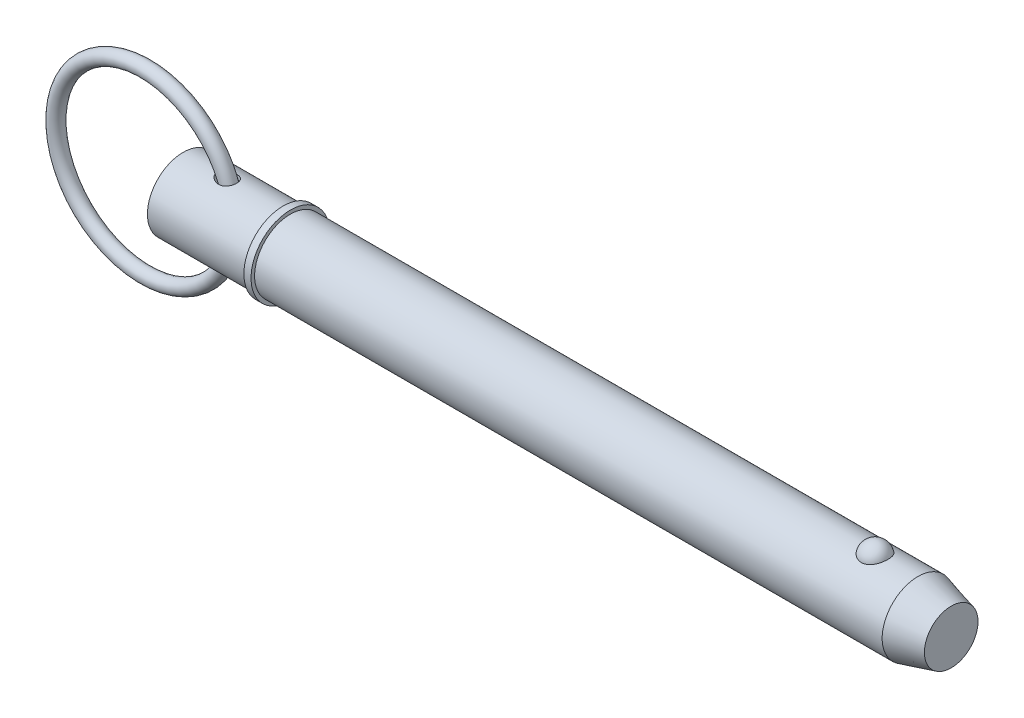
ISO-10303-21;
HEADER;
FILE_DESCRIPTION(('STEP AP214'),'2;1');
FILE_NAME('part.step','',(''),(''),'','','');
FILE_SCHEMA(('AUTOMOTIVE_DESIGN { 1 0 10303 214 1 1 1 1 }'));
ENDSEC;
DATA;
#1=APPLICATION_CONTEXT('core data for automotive mechanical design processes');
#2=APPLICATION_PROTOCOL_DEFINITION('international standard','automotive_design',2000,#1);
#3=PRODUCT_CONTEXT('',#1,'mechanical');
#4=PRODUCT('Part','Part','',(#3));
#5=PRODUCT_RELATED_PRODUCT_CATEGORY('part','',(#4));
#6=PRODUCT_DEFINITION_FORMATION('','',#4);
#7=PRODUCT_DEFINITION_CONTEXT('part definition',#1,'design');
#8=PRODUCT_DEFINITION('design','',#6,#7);
#9=PRODUCT_DEFINITION_SHAPE('','',#8);
#10=(LENGTH_UNIT() NAMED_UNIT(*) SI_UNIT(.MILLI.,.METRE.));
#11=(NAMED_UNIT(*) PLANE_ANGLE_UNIT() SI_UNIT($,.RADIAN.));
#12=(NAMED_UNIT(*) SI_UNIT($,.STERADIAN.) SOLID_ANGLE_UNIT());
#13=UNCERTAINTY_MEASURE_WITH_UNIT(LENGTH_MEASURE(1.E-05),#10,'distance_accuracy_value','');
#14=(GEOMETRIC_REPRESENTATION_CONTEXT(3) GLOBAL_UNCERTAINTY_ASSIGNED_CONTEXT((#13)) GLOBAL_UNIT_ASSIGNED_CONTEXT((#10,
#11,#12)) REPRESENTATION_CONTEXT('',''));
#15=CARTESIAN_POINT('',(0.,0.,0.));
#16=DIRECTION('',(0.,0.,1.));
#17=DIRECTION('',(1.,0.,0.));
#18=AXIS2_PLACEMENT_3D('',#15,#16,#17);
#19=CARTESIAN_POINT('',(-13.4840686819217,0.,0.));
#20=DIRECTION('',(0.,0.,1.));
#21=DIRECTION('',(1.,0.,0.));
#22=AXIS2_PLACEMENT_3D('',#19,#20,#21);
#23=TOROIDAL_SURFACE('',#22,31.75,2.54);
#24=CARTESIAN_POINT('',(20.8059313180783,0.,0.));
#25=VERTEX_POINT('',#24);
#26=VERTEX_LOOP('',#25);
#27=FACE_BOUND('',#26,.T.);
#28=ADVANCED_FACE('P0_F12',(#27),#23,.T.);
#29=CLOSED_SHELL('',(#28));
#30=MANIFOLD_SOLID_BREP('P0_B1',#29);
#31=CARTESIAN_POINT('',(0.,0.,0.));
#32=DIRECTION('',(1.,0.,0.));
#33=DIRECTION('',(0.,0.,-1.));
#34=AXIS2_PLACEMENT_3D('',#31,#32,#33);
#35=CYLINDRICAL_SURFACE('',#34,12.7);
#36=CARTESIAN_POINT('',(13.092900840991,12.5230976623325,-2.11234992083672));
#37=CARTESIAN_POINT('',(13.2535855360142,12.4976398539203,-2.26328363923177));
#38=CARTESIAN_POINT('',(13.4280602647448,12.4718592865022,-2.39955782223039));
#39=CARTESIAN_POINT('',(13.7976341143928,12.4229301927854,-2.64122157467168));
#40=CARTESIAN_POINT('',(13.9927568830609,12.3997847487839,-2.7465751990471));
#41=CARTESIAN_POINT('',(14.397672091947,12.3590534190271,-2.92439761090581));
#42=CARTESIAN_POINT('',(14.6074445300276,12.3414601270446,-2.99691026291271));
#43=CARTESIAN_POINT('',(15.0366557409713,12.3142893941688,-3.10669649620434));
#44=CARTESIAN_POINT('',(15.2560902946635,12.3047084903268,-3.14398530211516));
#45=CARTESIAN_POINT('',(15.5877843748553,12.2976819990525,-3.17128282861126));
#46=CARTESIAN_POINT('',(15.6989364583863,12.2965677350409,-3.17559470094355));
#47=CARTESIAN_POINT('',(15.9211629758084,12.2969101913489,-3.17427486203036));
#48=CARTESIAN_POINT('',(16.0322374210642,12.2983656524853,-3.16864802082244));
#49=CARTESIAN_POINT('',(16.2532861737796,12.3038832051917,-3.14715368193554));
#50=CARTESIAN_POINT('',(16.363260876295,12.3079443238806,-3.13129000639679));
#51=CARTESIAN_POINT('',(16.5810669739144,12.3185954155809,-3.08912320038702));
#52=CARTESIAN_POINT('',(16.6888986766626,12.3251850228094,-3.06282157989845));
#53=CARTESIAN_POINT('',(16.8894247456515,12.3398294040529,-3.00323791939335));
#54=CARTESIAN_POINT('',(16.9824664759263,12.3476389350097,-2.97106098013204));
#55=CARTESIAN_POINT('',(17.1651267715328,12.3648759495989,-2.89848824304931));
#56=CARTESIAN_POINT('',(17.2547457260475,12.3743032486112,-2.85809338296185));
#57=CARTESIAN_POINT('',(17.4297224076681,12.3944822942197,-2.76927391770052));
#58=CARTESIAN_POINT('',(17.5150817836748,12.40523352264,-2.72085245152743));
#59=CARTESIAN_POINT('',(17.6807665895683,12.4277046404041,-2.61629867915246));
#60=CARTESIAN_POINT('',(17.7610923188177,12.4394244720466,-2.56016683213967));
#61=CARTESIAN_POINT('',(17.9797287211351,12.4733252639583,-2.39133767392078));
#62=CARTESIAN_POINT('',(18.1114611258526,12.4961902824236,-2.27005507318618));
#63=CARTESIAN_POINT('',(18.3518677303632,12.5412050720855,-2.00648954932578));
#64=CARTESIAN_POINT('',(18.4605454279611,12.5633549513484,-1.86420981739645));
#65=CARTESIAN_POINT('',(18.6498843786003,12.6039384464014,-1.5661481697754));
#66=CARTESIAN_POINT('',(18.7311185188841,12.622444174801,-1.41073996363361));
#67=CARTESIAN_POINT('',(18.8669149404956,12.6543302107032,-1.08819514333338));
#68=CARTESIAN_POINT('',(18.921477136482,12.6677105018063,-0.921058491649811));
#69=CARTESIAN_POINT('',(19.0028875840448,12.6879542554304,-0.57902988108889));
#70=CARTESIAN_POINT('',(19.0296164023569,12.6947896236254,-0.40410783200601));
#71=CARTESIAN_POINT('',(19.0543673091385,12.7011128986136,-0.0521104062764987));
#72=CARTESIAN_POINT('',(19.0523885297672,12.7006005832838,0.124965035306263));
#73=CARTESIAN_POINT('',(19.019700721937,12.692266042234,0.476969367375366));
#74=CARTESIAN_POINT('',(18.9888798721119,12.6844153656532,0.651887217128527));
#75=CARTESIAN_POINT('',(18.8990221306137,12.6622099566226,0.99389064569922));
#76=CARTESIAN_POINT('',(18.839985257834,12.6478552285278,1.16097622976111));
#77=CARTESIAN_POINT('',(18.6951419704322,12.6142309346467,1.48231767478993));
#78=CARTESIAN_POINT('',(18.6093706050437,12.5949678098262,1.63659000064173));
#79=CARTESIAN_POINT('',(18.4131352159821,12.5536490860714,1.92810749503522));
#80=CARTESIAN_POINT('',(18.3026732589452,12.5315937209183,2.06535408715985));
#81=CARTESIAN_POINT('',(18.060669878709,12.4872833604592,2.31822774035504));
#82=CARTESIAN_POINT('',(17.9292520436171,12.4650302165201,2.43397343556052));
#83=CARTESIAN_POINT('',(17.6485957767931,12.4226514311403,2.64178289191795));
#84=CARTESIAN_POINT('',(17.4993587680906,12.4025256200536,2.73384854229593));
#85=CARTESIAN_POINT('',(17.1869531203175,12.3664726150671,2.8925825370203));
#86=CARTESIAN_POINT('',(17.0237450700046,12.3505578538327,2.95917592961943));
#87=CARTESIAN_POINT('',(16.6884731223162,12.3245177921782,3.06582547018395));
#88=CARTESIAN_POINT('',(16.516407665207,12.3143935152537,3.10587692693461));
#89=CARTESIAN_POINT('',(16.1604213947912,12.3003788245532,3.16093927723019));
#90=CARTESIAN_POINT('',(15.9763106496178,12.2967791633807,3.17478342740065));
#91=CARTESIAN_POINT('',(15.6080973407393,12.2966663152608,3.1752118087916));
#92=CARTESIAN_POINT('',(15.4239948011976,12.3001555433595,3.16178674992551));
#93=CARTESIAN_POINT('',(15.0417156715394,12.3141744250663,3.10676725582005));
#94=CARTESIAN_POINT('',(14.8439465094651,12.3253658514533,3.06251977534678));
#95=CARTESIAN_POINT('',(14.4574652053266,12.3538942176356,2.94531863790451));
#96=CARTESIAN_POINT('',(14.2687614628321,12.3712367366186,2.87233891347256));
#97=CARTESIAN_POINT('',(13.8856104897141,12.4121323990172,2.69045747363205));
#98=CARTESIAN_POINT('',(13.6926012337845,12.4361434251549,2.57861276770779));
#99=CARTESIAN_POINT('',(13.328588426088,12.4862632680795,2.32379935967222));
#100=CARTESIAN_POINT('',(13.1575718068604,12.5123708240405,2.18084927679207));
#101=CARTESIAN_POINT('',(12.8776146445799,12.5579467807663,1.89840233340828));
#102=CARTESIAN_POINT('',(12.7631663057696,12.5776642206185,1.76440341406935));
#103=CARTESIAN_POINT('',(12.5574911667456,12.6143643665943,1.47931295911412));
#104=CARTESIAN_POINT('',(12.4662309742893,12.6313509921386,1.32824646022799));
#105=CARTESIAN_POINT('',(12.3240650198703,12.6583901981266,1.03598403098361));
#106=CARTESIAN_POINT('',(12.2691183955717,12.6691064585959,0.89682285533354));
#107=CARTESIAN_POINT('',(12.1828741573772,12.6860954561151,0.611068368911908));
#108=CARTESIAN_POINT('',(12.1515620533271,12.6923709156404,0.464479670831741));
#109=CARTESIAN_POINT('',(12.1147168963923,12.6997676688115,0.167420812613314));
#110=CARTESIAN_POINT('',(12.109270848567,12.7008715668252,0.0169392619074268));
#111=CARTESIAN_POINT('',(12.1248234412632,12.6977391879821,-0.282592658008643));
#112=CARTESIAN_POINT('',(12.1458245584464,12.6935024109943,-0.431642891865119));
#113=CARTESIAN_POINT('',(12.210908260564,12.6805581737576,-0.716008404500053));
#114=CARTESIAN_POINT('',(12.2537133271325,12.6720986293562,-0.851633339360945));
#115=CARTESIAN_POINT('',(12.3591295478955,12.6516826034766,-1.11460776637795));
#116=CARTESIAN_POINT('',(12.4217455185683,12.6397252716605,-1.24195523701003));
#117=CARTESIAN_POINT('',(12.5735635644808,12.61152213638,-1.50300095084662));
#118=CARTESIAN_POINT('',(12.6652159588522,12.5949150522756,-1.63522875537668));
#119=CARTESIAN_POINT('',(12.8664347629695,12.5599626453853,-1.88501670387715));
#120=CARTESIAN_POINT('',(12.9760196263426,12.541615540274,-2.00256151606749));
#121=CARTESIAN_POINT('',(13.092900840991,12.5230976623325,-2.11234992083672));
#122=B_SPLINE_CURVE_WITH_KNOTS('',3,(#36,#37,#38,#39,#40,#41,#42,#43,#44,#45,#46,#47,#48,#49,
#50,#51,#52,#53,#54,#55,#56,#57,#58,#59,#60,#61,#62,#63,#64,#65,#66,#67,#68,#69,#70,#71,#72,#73,
#74,#75,#76,#77,#78,#79,#80,#81,#82,#83,#84,#85,#86,#87,#88,#89,#90,#91,#92,#93,#94,#95,#96,#97,
#98,#99,#100,#101,#102,#103,#104,#105,#106,#107,#108,#109,#110,#111,#112,#113,#114,#115,#116,
#117,#118,#119,#120,#121),.UNSPECIFIED.,.T.,.F.,(4,2,2,2,2,2,2,2,2,2,2,2,2,2,2,2,2,2,2,2,2,2,2,
2,2,2,2,2,2,2,2,2,2,2,2,2,2,2,2,2,2,2,4),(0.,0.665132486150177,1.33103515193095,
1.99604575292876,2.66076878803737,2.99410229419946,3.32727250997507,3.66031840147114,
3.99331613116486,4.28918991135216,4.58502994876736,4.88075456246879,5.17646157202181,
5.71510826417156,6.25367317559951,6.78017774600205,7.30668400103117,7.83544030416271,
8.36421259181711,8.89504347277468,9.42587399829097,9.95601150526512,10.4861046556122,
11.0131799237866,11.54021312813,12.0687854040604,12.597451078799,13.1491450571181,
13.7010270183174,14.3074556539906,14.914435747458,15.5844380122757,16.2540403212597,
16.7839879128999,17.3131679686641,17.7612578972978,18.2090728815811,18.658393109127,
19.1077554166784,19.5333866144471,19.959121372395,20.4424347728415,20.9262486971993),.UNSPECIFIED.);
#123=CARTESIAN_POINT('',(13.092900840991,12.5230976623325,-2.11234992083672));
#124=VERTEX_POINT('',#123);
#125=EDGE_CURVE('P1_E42',#124,#124,#122,.T.);
#126=ORIENTED_EDGE('',*,*,#125,.T.);
#127=EDGE_LOOP('',(#126));
#128=FACE_BOUND('',#127,.T.);
#129=CARTESIAN_POINT('',(0.,0.,0.));
#130=DIRECTION('',(1.,0.,0.));
#131=DIRECTION('',(0.,0.,-1.));
#132=AXIS2_PLACEMENT_3D('',#129,#130,#131);
#133=CIRCLE('',#132,12.7);
#134=CARTESIAN_POINT('',(0.,0.,-12.7));
#135=VERTEX_POINT('',#134);
#136=EDGE_CURVE('P1_E9',#135,#135,#133,.T.);
#137=ORIENTED_EDGE('',*,*,#136,.T.);
#138=EDGE_LOOP('',(#137));
#139=FACE_BOUND('',#138,.T.);
#140=CARTESIAN_POINT('',(35.56,0.,0.));
#141=DIRECTION('',(1.,0.,0.));
#142=DIRECTION('',(0.,0.,-1.));
#143=AXIS2_PLACEMENT_3D('',#140,#141,#142);
#144=CIRCLE('',#143,12.7);
#145=CARTESIAN_POINT('',(35.56,0.,-12.7));
#146=VERTEX_POINT('',#145);
#147=EDGE_CURVE('P1_E25',#146,#146,#144,.T.);
#148=ORIENTED_EDGE('',*,*,#147,.F.);
#149=EDGE_LOOP('',(#148));
#150=FACE_BOUND('',#149,.T.);
#151=CARTESIAN_POINT('',(13.092900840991,-12.5230976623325,-2.11234992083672));
#152=CARTESIAN_POINT('',(12.9659872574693,-12.5432050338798,-1.99314161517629));
#153=CARTESIAN_POINT('',(12.847667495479,-12.5631124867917,-1.86478966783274));
#154=CARTESIAN_POINT('',(12.6324721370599,-12.6007427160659,-1.59069749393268));
#155=CARTESIAN_POINT('',(12.5355833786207,-12.6184668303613,-1.444968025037));
#156=CARTESIAN_POINT('',(12.4099071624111,-12.642034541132,-1.21450950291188));
#157=CARTESIAN_POINT('',(12.3711427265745,-12.6494175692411,-1.13527163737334));
#158=CARTESIAN_POINT('',(12.3010994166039,-12.6628962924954,-0.973464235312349));
#159=CARTESIAN_POINT('',(12.2698164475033,-12.6689926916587,-0.890896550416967));
#160=CARTESIAN_POINT('',(12.2153933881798,-12.6796767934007,-0.72309085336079));
#161=CARTESIAN_POINT('',(12.192246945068,-12.6842656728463,-0.637854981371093));
#162=CARTESIAN_POINT('',(12.154603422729,-12.6917620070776,-0.465421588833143));
#163=CARTESIAN_POINT('',(12.1401047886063,-12.69466976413,-0.378224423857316));
#164=CARTESIAN_POINT('',(12.1214471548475,-12.6984180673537,-0.214417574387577));
#165=CARTESIAN_POINT('',(12.1161713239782,-12.699481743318,-0.13793855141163));
#166=CARTESIAN_POINT('',(12.1124989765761,-12.7002217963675,0.0152189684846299));
#167=CARTESIAN_POINT('',(12.1141046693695,-12.6998977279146,0.0918975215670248));
#168=CARTESIAN_POINT('',(12.1241695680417,-12.6978712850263,0.244746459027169));
#169=CARTESIAN_POINT('',(12.132625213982,-12.6961696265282,0.320917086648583));
#170=CARTESIAN_POINT('',(12.1562110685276,-12.6914452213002,0.472185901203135));
#171=CARTESIAN_POINT('',(12.1713438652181,-12.6884219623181,0.547283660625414));
#172=CARTESIAN_POINT('',(12.223731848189,-12.6780227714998,0.759415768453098));
#173=CARTESIAN_POINT('',(12.268839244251,-12.6691353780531,0.894507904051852));
#174=CARTESIAN_POINT('',(12.3786059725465,-12.6479567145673,1.1560647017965));
#175=CARTESIAN_POINT('',(12.4432700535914,-12.6356646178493,1.28252725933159));
#176=CARTESIAN_POINT('',(12.5971341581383,-12.607236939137,1.5381272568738));
#177=CARTESIAN_POINT('',(12.6882234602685,-12.5908303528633,1.66609325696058));
#178=CARTESIAN_POINT('',(12.887209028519,-12.5564642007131,1.90792082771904));
#179=CARTESIAN_POINT('',(12.995115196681,-12.5385037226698,2.02177401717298));
#180=CARTESIAN_POINT('',(13.2471335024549,-12.4987806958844,2.25547266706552));
#181=CARTESIAN_POINT('',(13.3941979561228,-12.4769622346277,2.3721269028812));
#182=CARTESIAN_POINT('',(13.7036983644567,-12.4349587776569,2.58329351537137));
#183=CARTESIAN_POINT('',(13.8661464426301,-12.4147750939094,2.67778822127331));
#184=CARTESIAN_POINT('',(14.2306024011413,-12.3748157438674,2.85722657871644));
#185=CARTESIAN_POINT('',(14.4347220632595,-12.3556533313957,2.93804226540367));
#186=CARTESIAN_POINT('',(14.8540416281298,-12.3245430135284,3.06594877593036));
#187=CARTESIAN_POINT('',(15.0692453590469,-12.3125976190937,3.11302786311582));
#188=CARTESIAN_POINT('',(15.3981213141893,-12.3014943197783,3.15648626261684));
#189=CARTESIAN_POINT('',(15.5100235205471,-12.298940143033,3.16639841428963));
#190=CARTESIAN_POINT('',(15.7342812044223,-12.2963942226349,3.17627668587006));
#191=CARTESIAN_POINT('',(15.8466364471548,-12.2964012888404,3.17624742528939));
#192=CARTESIAN_POINT('',(16.0707903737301,-12.2990694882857,3.16589868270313));
#193=CARTESIAN_POINT('',(16.1825892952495,-12.3017293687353,3.1555840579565));
#194=CARTESIAN_POINT('',(16.4046123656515,-12.3096862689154,3.12440163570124));
#195=CARTESIAN_POINT('',(16.514836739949,-12.314982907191,3.10353536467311));
#196=CARTESIAN_POINT('',(16.7211934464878,-12.3273933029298,3.05384263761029));
#197=CARTESIAN_POINT('',(16.8175961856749,-12.3342598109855,3.0260738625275));
#198=CARTESIAN_POINT('',(17.0073515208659,-12.3498131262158,2.96195947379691));
#199=CARTESIAN_POINT('',(17.100704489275,-12.3584997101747,2.92561491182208));
#200=CARTESIAN_POINT('',(17.2834584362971,-12.3774243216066,2.84448580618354));
#201=CARTESIAN_POINT('',(17.3728610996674,-12.3876616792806,2.79970490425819));
#202=CARTESIAN_POINT('',(17.5469061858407,-12.409352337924,2.701939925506));
#203=CARTESIAN_POINT('',(17.6315489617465,-12.4208055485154,2.64895645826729));
#204=CARTESIAN_POINT('',(17.7872886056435,-12.4433734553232,2.54070972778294));
#205=CARTESIAN_POINT('',(17.8589017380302,-12.4544123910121,2.4861716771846));
#206=CARTESIAN_POINT('',(17.9970802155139,-12.4768404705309,2.37105291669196));
#207=CARTESIAN_POINT('',(18.063643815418,-12.4882297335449,2.31047013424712));
#208=CARTESIAN_POINT('',(18.1911677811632,-12.5110137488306,2.18372894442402));
#209=CARTESIAN_POINT('',(18.2521311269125,-12.5224084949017,2.11757353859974));
#210=CARTESIAN_POINT('',(18.3680676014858,-12.5448751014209,1.98014449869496));
#211=CARTESIAN_POINT('',(18.4230385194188,-12.5559468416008,1.90886899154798));
#212=CARTESIAN_POINT('',(18.5752306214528,-12.5875288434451,1.6925769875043));
#213=CARTESIAN_POINT('',(18.6637018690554,-12.6071482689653,1.54111740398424));
#214=CARTESIAN_POINT('',(18.8143485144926,-12.6417556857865,1.225260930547));
#215=CARTESIAN_POINT('',(18.876524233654,-12.6567437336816,1.06086419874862));
#216=CARTESIAN_POINT('',(18.9733884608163,-12.6805238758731,0.723195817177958));
#217=CARTESIAN_POINT('',(19.0079967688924,-12.6892978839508,0.549899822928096));
#218=CARTESIAN_POINT('',(19.0486500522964,-12.6996362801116,0.199781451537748));
#219=CARTESIAN_POINT('',(19.054694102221,-12.7012004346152,0.0229589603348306));
#220=CARTESIAN_POINT('',(19.0380549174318,-12.6969431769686,-0.330044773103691));
#221=CARTESIAN_POINT('',(19.0152419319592,-12.6910884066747,-0.506219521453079));
#222=CARTESIAN_POINT('',(18.9411599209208,-12.672565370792,-0.852112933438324));
#223=CARTESIAN_POINT('',(18.8898907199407,-12.659897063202,-1.0218315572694));
#224=CARTESIAN_POINT('',(18.7600888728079,-12.6291327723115,-1.34987035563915));
#225=CARTESIAN_POINT('',(18.6815715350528,-12.6110398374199,-1.50819687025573));
#226=CARTESIAN_POINT('',(18.4991526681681,-12.5714188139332,-1.808997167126));
#227=CARTESIAN_POINT('',(18.3952529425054,-12.5498909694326,-1.95147207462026));
#228=CARTESIAN_POINT('',(18.1653806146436,-12.5059234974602,-2.21580059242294));
#229=CARTESIAN_POINT('',(18.0395297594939,-12.4834893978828,-2.33776101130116));
#230=CARTESIAN_POINT('',(17.7688701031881,-12.4400863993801,-2.55870399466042));
#231=CARTESIAN_POINT('',(17.624063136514,-12.4191173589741,-2.65768878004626));
#232=CARTESIAN_POINT('',(17.3196803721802,-12.380896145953,-2.8304192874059));
#233=CARTESIAN_POINT('',(17.1601036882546,-12.3636441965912,-2.90416349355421));
#234=CARTESIAN_POINT('',(16.8308162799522,-12.3345597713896,-3.02531546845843));
#235=CARTESIAN_POINT('',(16.6611041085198,-12.322728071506,-3.07271946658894));
#236=CARTESIAN_POINT('',(16.3099674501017,-12.3051318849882,-3.14246490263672));
#237=CARTESIAN_POINT('',(16.1283412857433,-12.2996014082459,-3.16384159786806));
#238=CARTESIAN_POINT('',(15.7639014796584,-12.2955807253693,-3.17942379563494));
#239=CARTESIAN_POINT('',(15.5810875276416,-12.2970924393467,-3.17362188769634));
#240=CARTESIAN_POINT('',(15.20154276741,-12.307074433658,-3.13470416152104));
#241=CARTESIAN_POINT('',(15.0050835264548,-12.316173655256,-3.09911848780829));
#242=CARTESIAN_POINT('',(14.6197996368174,-12.3407987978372,-2.99954607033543));
#243=CARTESIAN_POINT('',(14.4309834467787,-12.3563316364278,-2.93552875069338));
#244=CARTESIAN_POINT('',(14.0353751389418,-12.3949378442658,-2.76840280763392));
#245=CARTESIAN_POINT('',(13.8306109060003,-12.4188242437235,-2.66064798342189));
#246=CARTESIAN_POINT('',(13.4432099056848,-12.4696241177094,-2.4113475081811));
#247=CARTESIAN_POINT('',(13.2605568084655,-12.4965353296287,-2.26982702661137));
#248=CARTESIAN_POINT('',(13.092900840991,-12.5230976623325,-2.11234992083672));
#249=B_SPLINE_CURVE_WITH_KNOTS('',3,(#151,#152,#153,#154,#155,#156,#157,#158,#159,#160,#161,
#162,#163,#164,#165,#166,#167,#168,#169,#170,#171,#172,#173,#174,#175,#176,#177,#178,#179,#180,
#181,#182,#183,#184,#185,#186,#187,#188,#189,#190,#191,#192,#193,#194,#195,#196,#197,#198,#199,
#200,#201,#202,#203,#204,#205,#206,#207,#208,#209,#210,#211,#212,#213,#214,#215,#216,#217,#218,
#219,#220,#221,#222,#223,#224,#225,#226,#227,#228,#229,#230,#231,#232,#233,#234,#235,#236,#237,
#238,#239,#240,#241,#242,#243,#244,#245,#246,#247,#248),.UNSPECIFIED.,.T.,.F.,(4,2,2,2,2,2,2,2,
2,2,2,2,2,2,2,2,2,2,2,2,2,2,2,2,2,2,2,2,2,2,2,2,2,2,2,2,2,2,2,2,2,2,2,2,2,2,2,2,4),(0.,
0.525289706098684,1.05025590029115,1.31549608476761,1.58059075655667,1.84547798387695,
2.11031756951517,2.34000998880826,2.56977615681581,2.79942299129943,3.0291589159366,
3.45531787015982,3.8815803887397,4.35362362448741,4.82594586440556,5.39074449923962,
5.95599200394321,6.61421946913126,7.27267581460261,7.60939383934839,7.94595540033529,
8.2823580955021,8.61871213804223,8.91997243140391,9.22119579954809,9.52228943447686,
9.82336070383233,10.0950952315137,10.3669232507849,10.6386057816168,10.9103882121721,
11.4371688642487,11.9639430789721,12.4922442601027,13.0205625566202,13.5512648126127,
14.0819703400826,14.6123781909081,15.1427483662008,15.6702654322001,16.1977314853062,
16.7252292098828,17.2528024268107,17.7993878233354,18.3461222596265,18.9432829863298,
19.5410874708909,20.2355241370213,20.9294447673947),.UNSPECIFIED.);
#250=CARTESIAN_POINT('',(13.092900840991,-12.5230976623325,-2.11234992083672));
#251=VERTEX_POINT('',#250);
#252=EDGE_CURVE('P1_E17',#251,#251,#249,.T.);
#253=ORIENTED_EDGE('',*,*,#252,.T.);
#254=EDGE_LOOP('',(#253));
#255=FACE_BOUND('',#254,.T.);
#256=ADVANCED_FACE('P1_F13',(#128,#139,#150,#255),#35,.T.);
#257=CARTESIAN_POINT('',(0.,0.,0.));
#258=DIRECTION('',(1.,0.,0.));
#259=DIRECTION('',(0.,0.,-1.));
#260=AXIS2_PLACEMENT_3D('',#257,#258,#259);
#261=CYLINDRICAL_SURFACE('',#260,12.7);
#262=CARTESIAN_POINT('',(261.200738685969,0.,0.));
#263=DIRECTION('',(1.,0.,0.));
#264=DIRECTION('',(0.,0.,-1.));
#265=AXIS2_PLACEMENT_3D('',#262,#263,#264);
#266=CIRCLE('',#265,12.7);
#267=CARTESIAN_POINT('',(261.200738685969,0.,-12.7));
#268=VERTEX_POINT('',#267);
#269=EDGE_CURVE('P1_E99',#268,#268,#266,.T.);
#270=ORIENTED_EDGE('',*,*,#269,.F.);
#271=EDGE_LOOP('',(#270));
#272=FACE_BOUND('',#271,.T.);
#273=CARTESIAN_POINT('',(38.1,0.,0.));
#274=DIRECTION('',(1.,0.,0.));
#275=DIRECTION('',(0.,0.,-1.));
#276=AXIS2_PLACEMENT_3D('',#273,#274,#275);
#277=CIRCLE('',#276,12.7);
#278=CARTESIAN_POINT('',(38.1,0.,-12.7));
#279=VERTEX_POINT('',#278);
#280=EDGE_CURVE('P1_E96',#279,#279,#277,.T.);
#281=ORIENTED_EDGE('',*,*,#280,.T.);
#282=EDGE_LOOP('',(#281));
#283=FACE_BOUND('',#282,.T.);
#284=CARTESIAN_POINT('',(245.960042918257,11.7500437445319,4.8193850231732));
#285=CARTESIAN_POINT('',(245.835088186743,11.7500430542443,4.81938571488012));
#286=CARTESIAN_POINT('',(245.710144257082,11.7520975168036,4.81438658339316));
#287=CARTESIAN_POINT('',(245.461142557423,11.760253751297,4.79442904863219));
#288=CARTESIAN_POINT('',(245.337085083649,11.7663568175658,4.77946746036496));
#289=CARTESIAN_POINT('',(245.090901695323,11.7824262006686,4.73971414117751));
#290=CARTESIAN_POINT('',(244.968774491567,11.7923898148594,4.71492928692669));
#291=CARTESIAN_POINT('',(244.727187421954,11.8158938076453,4.65571340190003));
#292=CARTESIAN_POINT('',(244.60772859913,11.8294355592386,4.62127866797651));
#293=CARTESIAN_POINT('',(244.372557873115,11.8596812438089,4.54309502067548));
#294=CARTESIAN_POINT('',(244.256839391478,11.8763792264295,4.49936361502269));
#295=CARTESIAN_POINT('',(244.029653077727,11.9124878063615,4.40287235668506));
#296=CARTESIAN_POINT('',(243.918186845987,11.9318994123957,4.35010914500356));
#297=CARTESIAN_POINT('',(243.591278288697,11.9934256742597,4.17881316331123));
#298=CARTESIAN_POINT('',(243.383127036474,12.038858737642,4.04720756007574));
#299=CARTESIAN_POINT('',(242.985850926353,12.1352173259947,3.748564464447));
#300=CARTESIAN_POINT('',(242.797443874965,12.1862630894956,3.58061821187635));
#301=CARTESIAN_POINT('',(242.450521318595,12.2875163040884,3.21600758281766));
#302=CARTESIAN_POINT('',(242.292011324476,12.3377235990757,3.01933792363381));
#303=CARTESIAN_POINT('',(242.00168878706,12.4344923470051,2.592916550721));
#304=CARTESIAN_POINT('',(241.871376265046,12.4807925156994,2.36208286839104));
#305=CARTESIAN_POINT('',(241.649407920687,12.5623454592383,1.88070399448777));
#306=CARTESIAN_POINT('',(241.557755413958,12.5975972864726,1.63015711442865));
#307=CARTESIAN_POINT('',(241.414046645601,12.6538414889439,1.11298869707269));
#308=CARTESIAN_POINT('',(241.362499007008,12.6746503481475,0.846205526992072));
#309=CARTESIAN_POINT('',(241.301977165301,12.699153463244,0.307085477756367));
#310=CARTESIAN_POINT('',(241.293001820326,12.7028481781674,0.0347487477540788));
#311=CARTESIAN_POINT('',(241.317731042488,12.6927785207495,-0.50607334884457));
#312=CARTESIAN_POINT('',(241.351189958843,12.6791146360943,-0.774571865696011));
#313=CARTESIAN_POINT('',(241.459687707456,12.635882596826,-1.30170246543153));
#314=CARTESIAN_POINT('',(241.53472729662,12.606314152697,-1.56033436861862));
#315=CARTESIAN_POINT('',(241.72500006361,12.5342328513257,-2.0608389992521));
#316=CARTESIAN_POINT('',(241.840287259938,12.4917026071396,-2.30268867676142));
#317=CARTESIAN_POINT('',(242.108704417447,12.3981123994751,-2.76259600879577));
#318=CARTESIAN_POINT('',(242.261837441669,12.3470517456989,-2.98065173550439));
#319=CARTESIAN_POINT('',(242.603507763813,12.2416045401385,-3.38786328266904));
#320=CARTESIAN_POINT('',(242.792201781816,12.1872040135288,-3.57688418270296));
#321=CARTESIAN_POINT('',(243.200239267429,12.0814086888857,-3.91941073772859));
#322=CARTESIAN_POINT('',(243.419580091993,12.0300136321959,-4.07291945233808));
#323=CARTESIAN_POINT('',(243.878375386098,11.9373542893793,-4.3369128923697));
#324=CARTESIAN_POINT('',(244.117304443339,11.8958982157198,-4.44824125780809));
#325=CARTESIAN_POINT('',(244.61243761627,11.8268116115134,-4.62881985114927));
#326=CARTESIAN_POINT('',(244.868635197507,11.7991758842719,-4.69808589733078));
#327=CARTESIAN_POINT('',(245.377164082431,11.7622209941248,-4.78983181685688));
#328=CARTESIAN_POINT('',(245.629041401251,11.7520502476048,-4.81449025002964));
#329=CARTESIAN_POINT('',(246.133573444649,11.7485796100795,-4.82295735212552));
#330=CARTESIAN_POINT('',(246.386228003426,11.7552763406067,-4.80677420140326));
#331=CARTESIAN_POINT('',(246.876834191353,11.7842584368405,-4.73525430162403));
#332=CARTESIAN_POINT('',(247.114998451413,11.8060486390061,-4.68116061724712));
#333=CARTESIAN_POINT('',(247.578489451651,11.8622750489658,-4.53678133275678));
#334=CARTESIAN_POINT('',(247.803815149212,11.8967122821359,-4.44649279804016));
#335=CARTESIAN_POINT('',(248.240801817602,11.9754603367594,-4.22987613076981));
#336=CARTESIAN_POINT('',(248.452057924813,12.0199699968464,-4.10280539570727));
#337=CARTESIAN_POINT('',(248.850601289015,12.1138028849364,-3.81685409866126));
#338=CARTESIAN_POINT('',(249.037883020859,12.163127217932,-3.65796622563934));
#339=CARTESIAN_POINT('',(249.393350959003,12.2642343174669,-3.30364864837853));
#340=CARTESIAN_POINT('',(249.560111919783,12.3160165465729,-3.10678783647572));
#341=CARTESIAN_POINT('',(249.859579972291,12.4142566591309,-2.68748409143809));
#342=CARTESIAN_POINT('',(249.992280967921,12.4607135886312,-2.46503658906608));
#343=CARTESIAN_POINT('',(250.224691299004,12.5450236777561,-1.99289519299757));
#344=CARTESIAN_POINT('',(250.323215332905,12.5825557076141,-1.74255918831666));
#345=CARTESIAN_POINT('',(250.479227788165,12.6431720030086,-1.22773734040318));
#346=CARTESIAN_POINT('',(250.536715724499,12.6662560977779,-0.963251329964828));
#347=CARTESIAN_POINT('',(250.609544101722,12.6956486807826,-0.427355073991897));
#348=CARTESIAN_POINT('',(250.624837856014,12.7019385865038,-0.15593749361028));
#349=CARTESIAN_POINT('',(250.612779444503,12.6970201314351,0.385928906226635));
#350=CARTESIAN_POINT('',(250.58542805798,12.6858120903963,0.656377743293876));
#351=CARTESIAN_POINT('',(250.513060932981,12.6568455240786,1.05454017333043));
#352=CARTESIAN_POINT('',(250.483796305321,12.6451962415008,1.18577850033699));
#353=CARTESIAN_POINT('',(250.415022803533,12.6181819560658,1.4451380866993));
#354=CARTESIAN_POINT('',(250.375517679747,12.6028183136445,1.57326046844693));
#355=CARTESIAN_POINT('',(250.286439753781,12.5687547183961,1.82554978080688));
#356=CARTESIAN_POINT('',(250.236862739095,12.5500533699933,1.94971503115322));
#357=CARTESIAN_POINT('',(250.12792115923,12.5098093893,2.19314370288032));
#358=CARTESIAN_POINT('',(250.068560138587,12.4882677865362,2.31240887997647));
#359=CARTESIAN_POINT('',(249.93997128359,12.4427679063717,2.5459303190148));
#360=CARTESIAN_POINT('',(249.870688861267,12.4187964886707,2.66015396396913));
#361=CARTESIAN_POINT('',(249.722903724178,12.3691892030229,2.88202659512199));
#362=CARTESIAN_POINT('',(249.644404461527,12.3435539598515,2.98967802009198));
#363=CARTESIAN_POINT('',(249.47855022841,12.2912955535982,3.1977438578));
#364=CARTESIAN_POINT('',(249.391191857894,12.2646720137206,3.29815546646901));
#365=CARTESIAN_POINT('',(249.208161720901,12.2111945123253,3.49095035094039));
#366=CARTESIAN_POINT('',(249.112493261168,12.1843406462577,3.5833367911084));
#367=CARTESIAN_POINT('',(248.913627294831,12.1312249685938,3.75922876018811));
#368=CARTESIAN_POINT('',(248.810450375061,12.104961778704,3.84275713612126));
#369=CARTESIAN_POINT('',(248.597013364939,12.0537284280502,4.00056406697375));
#370=CARTESIAN_POINT('',(248.486756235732,12.028757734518,4.07484645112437));
#371=CARTESIAN_POINT('',(248.259755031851,11.9808306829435,4.21367959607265));
#372=CARTESIAN_POINT('',(248.143006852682,11.9578756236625,4.27822410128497));
#373=CARTESIAN_POINT('',(247.90394258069,11.9147184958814,4.39698483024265));
#374=CARTESIAN_POINT('',(247.781628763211,11.894515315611,4.45120522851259));
#375=CARTESIAN_POINT('',(247.522952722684,11.8561129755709,4.55255353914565));
#376=CARTESIAN_POINT('',(247.386223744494,11.8381764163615,4.59884858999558));
#377=CARTESIAN_POINT('',(247.108608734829,11.8069093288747,4.67853897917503));
#378=CARTESIAN_POINT('',(246.967724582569,11.7935767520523,4.71194005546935));
#379=CARTESIAN_POINT('',(246.68309446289,11.7720277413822,4.76552188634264));
#380=CARTESIAN_POINT('',(246.539348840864,11.7638106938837,4.78570422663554));
#381=CARTESIAN_POINT('',(246.250411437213,11.7528195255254,4.81263433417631));
#382=CARTESIAN_POINT('',(246.105219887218,11.7500445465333,4.81938421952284));
#383=CARTESIAN_POINT('',(245.960042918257,11.7500437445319,4.8193850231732));
#384=B_SPLINE_CURVE_WITH_KNOTS('',3,(#284,#285,#286,#287,#288,#289,#290,#291,#292,#293,#294,
#295,#296,#297,#298,#299,#300,#301,#302,#303,#304,#305,#306,#307,#308,#309,#310,#311,#312,#313,
#314,#315,#316,#317,#318,#319,#320,#321,#322,#323,#324,#325,#326,#327,#328,#329,#330,#331,#332,
#333,#334,#335,#336,#337,#338,#339,#340,#341,#342,#343,#344,#345,#346,#347,#348,#349,#350,#351,
#352,#353,#354,#355,#356,#357,#358,#359,#360,#361,#362,#363,#364,#365,#366,#367,#368,#369,#370,
#371,#372,#373,#374,#375,#376,#377,#378,#379,#380,#381,#382,#383),.UNSPECIFIED.,.T.,.F.,(4,2,2,
2,2,2,2,2,2,2,2,2,2,2,2,2,2,2,2,2,2,2,2,2,2,2,2,2,2,2,2,2,2,2,2,2,2,2,2,2,2,2,2,2,2,2,2,2,2,4),
(0.,0.374729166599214,0.749578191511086,1.12416526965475,1.49889629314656,1.87292776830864,
2.24709865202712,2.99481328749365,3.7639944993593,4.53331735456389,5.33683915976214,
6.14042986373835,6.95405296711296,7.76765424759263,8.57656703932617,9.38549455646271,
10.1955119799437,11.0055949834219,11.8193353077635,12.6330054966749,13.4294141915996,
14.2255231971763,14.9815786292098,15.7374826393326,16.4696948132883,17.2019663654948,
17.9501979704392,18.6986017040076,19.4844704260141,20.2704797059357,21.0815215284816,
21.8925729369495,22.70452139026,23.5164550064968,23.9209608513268,24.3253187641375,
24.7298461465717,25.1342272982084,25.5409255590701,25.947471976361,26.3541750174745,
26.7607169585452,27.166183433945,27.5714814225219,27.9770386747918,28.3824315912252,
28.8181206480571,29.2536155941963,29.6890582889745,30.1244323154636),.UNSPECIFIED.);
#385=CARTESIAN_POINT('',(245.960042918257,11.7500437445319,4.8193850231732));
#386=VERTEX_POINT('',#385);
#387=EDGE_CURVE('P1_E34',#386,#386,#384,.T.);
#388=ORIENTED_EDGE('',*,*,#387,.T.);
#389=EDGE_LOOP('',(#388));
#390=FACE_BOUND('',#389,.T.);
#391=ADVANCED_FACE('P1_F46',(#272,#283,#390),#261,.T.);
#392=CARTESIAN_POINT('',(0.,0.,0.));
#393=DIRECTION('',(-1.,0.,0.));
#394=DIRECTION('',(0.,0.,1.));
#395=AXIS2_PLACEMENT_3D('',#392,#393,#394);
#396=PLANE('',#395);
#397=ORIENTED_EDGE('',*,*,#136,.F.);
#398=EDGE_LOOP('',(#397));
#399=FACE_BOUND('',#398,.T.);
#400=ADVANCED_FACE('P1_F15',(#399),#396,.T.);
#401=CARTESIAN_POINT('',(35.56,12.7,0.));
#402=DIRECTION('',(-1.,0.,0.));
#403=DIRECTION('',(0.,0.,1.));
#404=AXIS2_PLACEMENT_3D('',#401,#402,#403);
#405=PLANE('',#404);
#406=ORIENTED_EDGE('',*,*,#147,.T.);
#407=EDGE_LOOP('',(#406));
#408=FACE_BOUND('',#407,.T.);
#409=CARTESIAN_POINT('',(35.56,0.,0.));
#410=DIRECTION('',(1.,0.,0.));
#411=DIRECTION('',(0.,0.,-1.));
#412=AXIS2_PLACEMENT_3D('',#409,#410,#411);
#413=CIRCLE('',#412,13.97);
#414=CARTESIAN_POINT('',(35.56,0.,-13.97));
#415=VERTEX_POINT('',#414);
#416=EDGE_CURVE('P1_E30',#415,#415,#413,.T.);
#417=ORIENTED_EDGE('',*,*,#416,.F.);
#418=EDGE_LOOP('',(#417));
#419=FACE_BOUND('',#418,.T.);
#420=ADVANCED_FACE('P1_F81',(#408,#419),#405,.T.);
#421=CARTESIAN_POINT('',(0.,0.,0.));
#422=DIRECTION('',(1.,0.,0.));
#423=DIRECTION('',(0.,0.,-1.));
#424=AXIS2_PLACEMENT_3D('',#421,#422,#423);
#425=CYLINDRICAL_SURFACE('',#424,13.97);
#426=ORIENTED_EDGE('',*,*,#416,.T.);
#427=EDGE_LOOP('',(#426));
#428=FACE_BOUND('',#427,.T.);
#429=CARTESIAN_POINT('',(38.1,0.,0.));
#430=DIRECTION('',(1.,0.,0.));
#431=DIRECTION('',(0.,0.,-1.));
#432=AXIS2_PLACEMENT_3D('',#429,#430,#431);
#433=CIRCLE('',#432,13.97);
#434=CARTESIAN_POINT('',(38.1,0.,-13.97));
#435=VERTEX_POINT('',#434);
#436=EDGE_CURVE('P1_E95',#435,#435,#433,.T.);
#437=ORIENTED_EDGE('',*,*,#436,.F.);
#438=EDGE_LOOP('',(#437));
#439=FACE_BOUND('',#438,.T.);
#440=ADVANCED_FACE('P1_F68',(#428,#439),#425,.T.);
#441=CARTESIAN_POINT('',(38.1,13.97,0.));
#442=DIRECTION('',(1.,0.,0.));
#443=DIRECTION('',(0.,0.,-1.));
#444=AXIS2_PLACEMENT_3D('',#441,#442,#443);
#445=PLANE('',#444);
#446=ORIENTED_EDGE('',*,*,#436,.T.);
#447=EDGE_LOOP('',(#446));
#448=FACE_BOUND('',#447,.T.);
#449=ORIENTED_EDGE('',*,*,#280,.F.);
#450=EDGE_LOOP('',(#449));
#451=FACE_BOUND('',#450,.T.);
#452=ADVANCED_FACE('P1_F62',(#448,#451),#445,.T.);
#453=CARTESIAN_POINT('',(273.05,0.,0.));
#454=DIRECTION('',(-1.,0.,0.));
#455=DIRECTION('',(0.,0.,1.));
#456=AXIS2_PLACEMENT_3D('',#453,#454,#455);
#457=CONICAL_SURFACE('',#456,9.52500000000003,0.26179938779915);
#458=ORIENTED_EDGE('',*,*,#269,.T.);
#459=EDGE_LOOP('',(#458));
#460=FACE_BOUND('',#459,.T.);
#461=CARTESIAN_POINT('',(273.05,0.,0.));
#462=DIRECTION('',(1.,0.,0.));
#463=DIRECTION('',(0.,0.,-1.));
#464=AXIS2_PLACEMENT_3D('',#461,#462,#463);
#465=CIRCLE('',#464,9.52500000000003);
#466=CARTESIAN_POINT('',(273.05,0.,-9.52500000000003));
#467=VERTEX_POINT('',#466);
#468=EDGE_CURVE('P1_E41',#467,#467,#465,.T.);
#469=ORIENTED_EDGE('',*,*,#468,.F.);
#470=EDGE_LOOP('',(#469));
#471=FACE_BOUND('',#470,.T.);
#472=ADVANCED_FACE('P1_F59',(#460,#471),#457,.T.);
#473=CARTESIAN_POINT('',(273.05,9.52500000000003,0.));
#474=DIRECTION('',(1.,0.,0.));
#475=DIRECTION('',(0.,0.,-1.));
#476=AXIS2_PLACEMENT_3D('',#473,#474,#475);
#477=PLANE('',#476);
#478=ORIENTED_EDGE('',*,*,#468,.T.);
#479=EDGE_LOOP('',(#478));
#480=FACE_BOUND('',#479,.T.);
#481=ADVANCED_FACE('P1_F55',(#480),#477,.T.);
#482=CARTESIAN_POINT('',(245.960042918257,11.43,0.));
#483=DIRECTION('',(-1.,0.,0.));
#484=DIRECTION('',(0.,1.,0.));
#485=AXIS2_PLACEMENT_3D('',#482,#483,#484);
#486=SPHERICAL_SURFACE('',#485,4.83000000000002);
#487=ORIENTED_EDGE('',*,*,#387,.F.);
#488=EDGE_LOOP('',(#487));
#489=FACE_BOUND('',#488,.T.);
#490=ADVANCED_FACE('P1_F50',(#489),#486,.T.);
#491=CARTESIAN_POINT('',(-13.4840686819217,0.,0.));
#492=DIRECTION('',(0.,0.,1.));
#493=DIRECTION('',(1.,0.,0.));
#494=AXIS2_PLACEMENT_3D('',#491,#492,#493);
#495=TOROIDAL_SURFACE('',#494,31.75,3.175);
#496=ORIENTED_EDGE('',*,*,#252,.F.);
#497=EDGE_LOOP('',(#496));
#498=FACE_BOUND('',#497,.T.);
#499=ORIENTED_EDGE('',*,*,#125,.F.);
#500=EDGE_LOOP('',(#499));
#501=FACE_BOUND('',#500,.T.);
#502=ADVANCED_FACE('P1_F54',(#498,#501),#495,.F.);
#503=CLOSED_SHELL('',(#256,#391,#400,#420,#440,#452,#472,#481,#490,#502));
#504=MANIFOLD_SOLID_BREP('P1_B1',#503);
#505=ADVANCED_BREP_SHAPE_REPRESENTATION('',(#18,#30,#504),#14);
#506=SHAPE_DEFINITION_REPRESENTATION(#9,#505);
ENDSEC;
END-ISO-10303-21;
